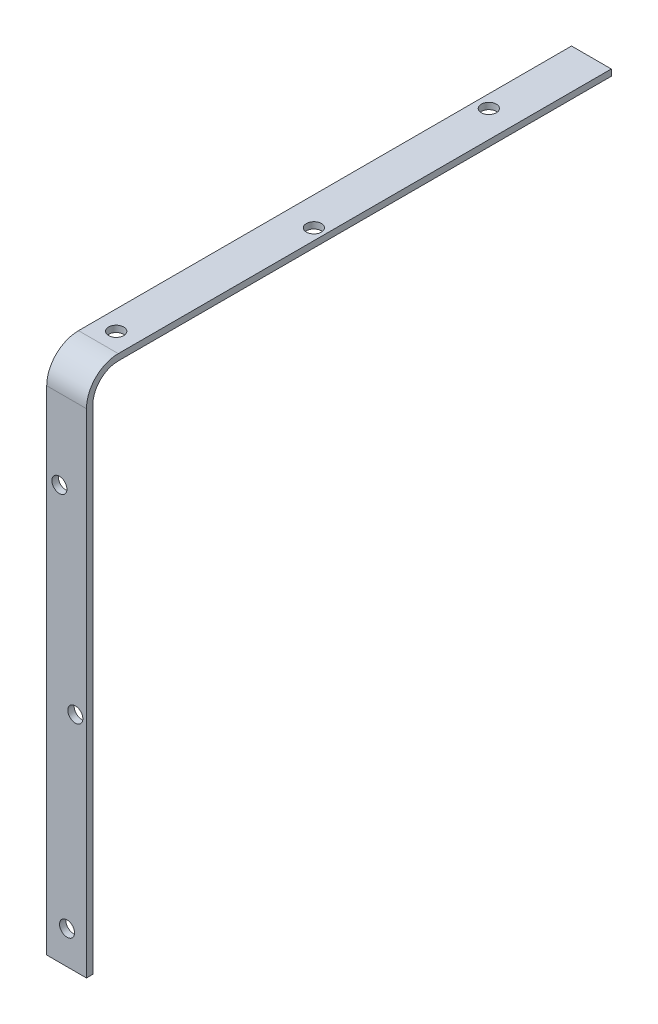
from build123d import *

# Parameters (mm, degrees)
EXTRUDE_THIN1_DEPTH       = 15.875
M7X1_0_TAPPED_HOLE1_D     = 6
M7X1_0_TAPPED_HOLE1_DEPTH = 17.02
M7X1_0_TAPPED_HOLE1_TIP   = 1.802581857
M7X1_0_TAPPED_HOLE2_D     = 6
M7X1_0_TAPPED_HOLE2_DEPTH = 17.02
M7X1_0_TAPPED_HOLE2_TIP   = 1.802581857


with BuildPart() as part:
    # Sketch2 → Extrude-Thin1 (new body)
    with BuildSketch(Plane(origin=(0, 0, 0), x_dir=(0, 0, -1), z_dir=(1, 0, 0))):
        with BuildLine():
            Line((0, 0), (0, 196.85))
            ThreePointArc((0, 196.85), (3.719743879, 205.830256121), (12.7, 209.55))
            Line((12.7, 209.55), (209.55, 209.55))
            Line((209.55, 209.55), (209.55, 207.01))
            Line((209.55, 207.01), (12.7, 207.01))
            ThreePointArc((12.7, 207.01), (5.515795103, 204.034204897), (2.54, 196.85))
            Line((2.54, 196.85), (2.54, 0))
            Line((2.54, 0), (0, 0))
        make_face()
    extrude(amount=EXTRUDE_THIN1_DEPTH)

    # M7x1.0 Tapped Hole1
    with Locations(Plane(origin=(0, 209.55, 0), x_dir=(1, 0, 0), z_dir=(0, 1, 0))):
        with Locations((5.08, 171.45), (11.43, 95.25), (7.747, 20)):
            Hole(M7X1_0_TAPPED_HOLE1_D / 2, depth=M7X1_0_TAPPED_HOLE1_DEPTH)
            with Locations((0, 0, -(M7X1_0_TAPPED_HOLE1_DEPTH + M7X1_0_TAPPED_HOLE1_TIP / 2))):  # 118° drill point
                Cone(0, M7X1_0_TAPPED_HOLE1_D / 2, M7X1_0_TAPPED_HOLE1_TIP, mode=Mode.SUBTRACT)

    # M7x1.0 Tapped Hole2
    with Locations(Plane.XY):
        with Locations((5.08, 165.1), (11.43, 88.9), (8.128, 13.212652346)):
            Hole(M7X1_0_TAPPED_HOLE2_D / 2, depth=M7X1_0_TAPPED_HOLE2_DEPTH)
            with Locations((0, 0, -(M7X1_0_TAPPED_HOLE2_DEPTH + M7X1_0_TAPPED_HOLE2_TIP / 2))):  # 118° drill point
                Cone(0, M7X1_0_TAPPED_HOLE2_D / 2, M7X1_0_TAPPED_HOLE2_TIP, mode=Mode.SUBTRACT)


solid = part.part
